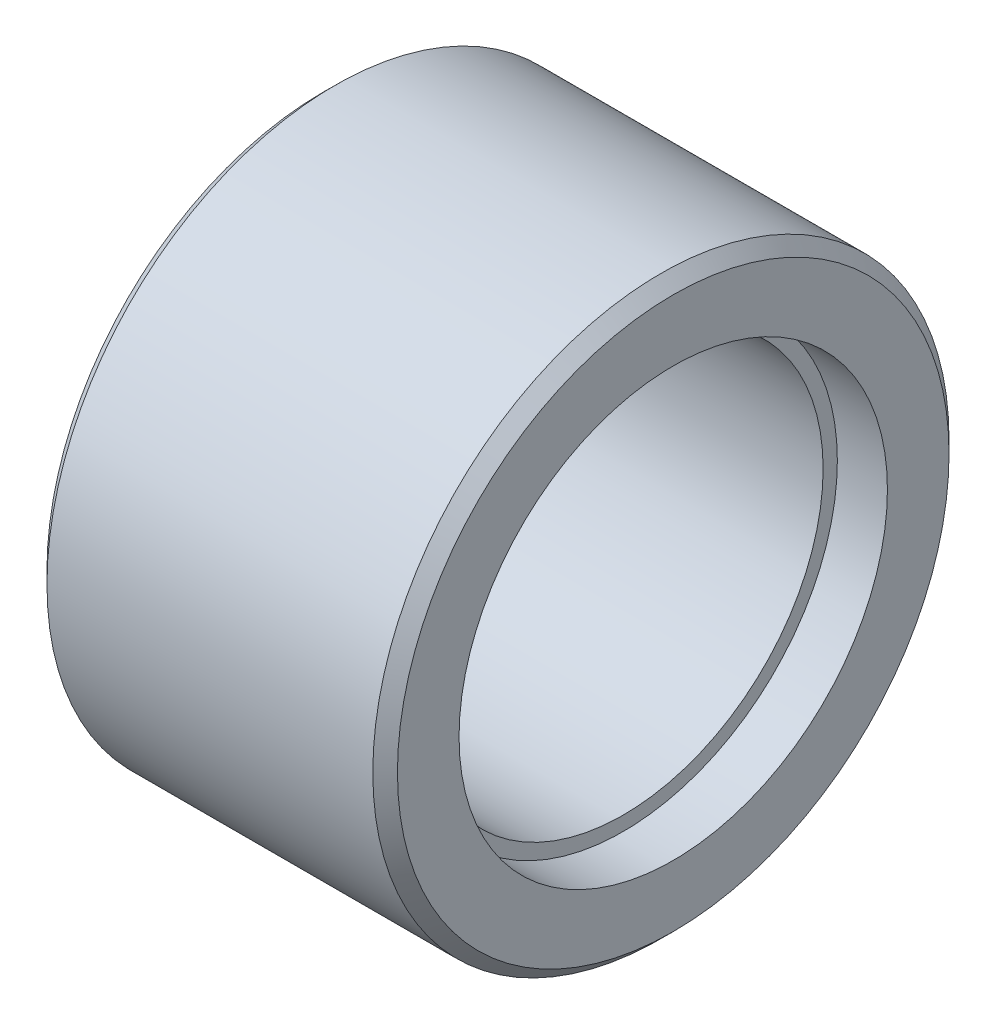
from build123d import *


with BuildPart() as part:
    # Sketch1 → Revolve1 (revolve)
    with BuildSketch(Plane.XY, mode=Mode.PRIVATE) as revolve1_sk:
        Polygon((-75.899656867, 8.69315), (-73.867656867, 8.69315), (-73.867656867, 8.1153), (-63.707656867, 8.1153), (-63.707656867, 8.69315), (-61.675656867, 8.69315), (-61.675656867, 11.19315), (-62.175656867, 11.69315), (-75.399656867, 11.69315), (-75.899656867, 11.19315), align=None)
    revolve(revolve1_sk.sketch.rotate(Axis((0, 0, 0), (-1, 0, 0)), 90), axis=Axis((0, 0, 0), (-1, 0, 0)))


solid = part.part
